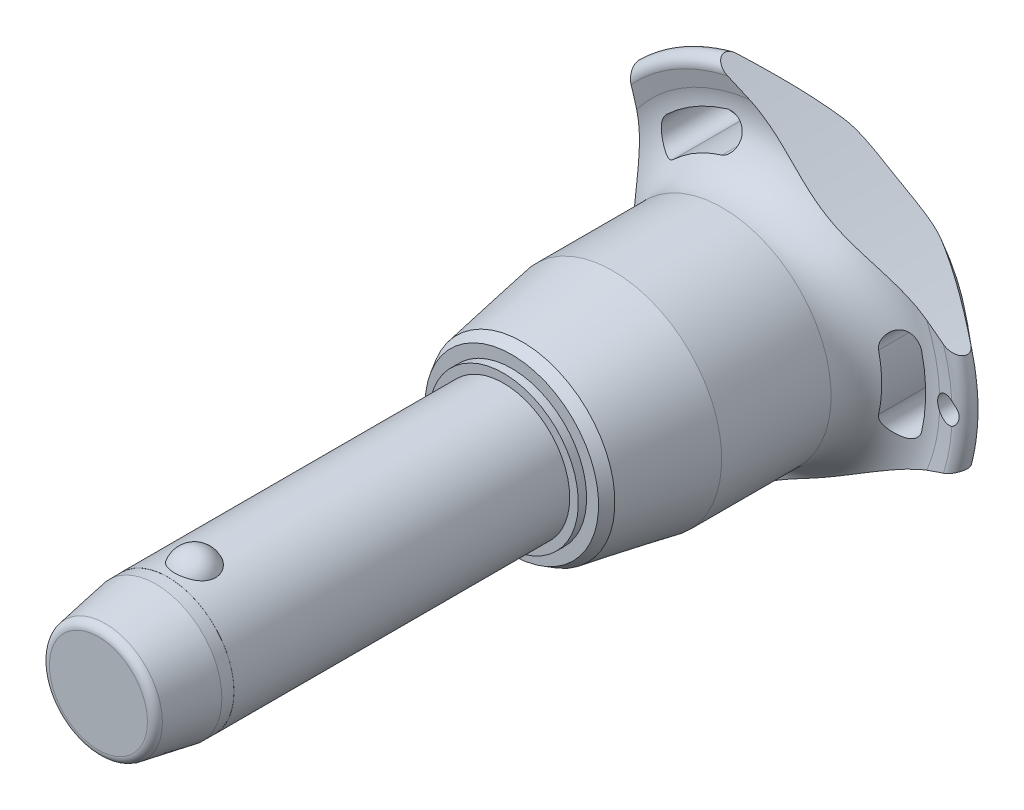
from build123d import *

# Parameters (mm, degrees)
SKETCH1_R           = 8
BOSS_EXTRUDE1_DEPTH = 35
SKETCH2_R           = 7
BOSS_EXTRUDE2_DEPTH = 39.7
BOSS_EXTRUDE3_START = 14
SKETCH1_2_R         = 8
BOSS_EXTRUDE3_DEPTH = 14
CHAMFER1_SIZE       = 7
CHAMFER1_SIZE2      = 1.234288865
FILLET1_R           = 1
SKETCH6_R           = 144.275
CUT_EXTRUDE1_DEPTH  = 82.935434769
CIRPATTERN1_COUNT   = 3
SKETCH7_R           = 1.5
CUT_EXTRUDE2_DEPTH  = 82.690131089
SKETCH8_R           = 8
SKETCH8_R_2         = 7.99
CUT_EXTRUDE3_DEPTH  = 8.4


with BuildPart() as part:
    # Sketch1 → Boss-Extrude1 (new body)
    with BuildSketch(Plane.XY):
        Circle(SKETCH1_R)
    extrude(amount=-BOSS_EXTRUDE1_DEPTH)

    # Sketch2 → Boss-Extrude2 (add)
    with BuildSketch(Plane(origin=(0, 0, -35), x_dir=(-1, 0, 0), z_dir=(0, 0, -1))):
        Circle(SKETCH2_R)
    extrude(amount=BOSS_EXTRUDE2_DEPTH)

    # Sketch3 → Revolve1 (revolve)
    with BuildSketch(Plane(origin=(0, 0, 0), x_dir=(0, 0, -1), z_dir=(1, 0, 0))):
        with BuildLine():
            Line((-2.387467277, 9.5), (-2.387467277, 4.2))
            ThreePointArc((-2.387467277, 4.2), (0.262532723, 6.85), (-2.387467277, 9.5))
        make_face()
        with BuildLine():
            Line((-2.387467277, -4.2), (-2.387467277, -9.5))
            ThreePointArc((-2.387467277, -9.5), (0.262532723, -6.85), (-2.387467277, -4.2))
        make_face()
    revolve(axis=Axis((0, -4.2, 2.387467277), (0, 1, 0)))

    # Sketch1_2 → Boss-Extrude3 (add)
    with BuildSketch(Plane.XY.offset(BOSS_EXTRUDE3_START)):
        Circle(SKETCH1_2_R)
    extrude(amount=-BOSS_EXTRUDE3_DEPTH)

    # Chamfer1
    chamfer1_edges = [part.edges().sort_by_distance(p)[0] for p in [
        (-8, 0, 14),
    ]]
    chamfer1_side = [part.faces().sort_by_distance(p)[0] for p in [
        (-8, 0, -10.5),
    ]]
    chamfer(chamfer1_edges, length=CHAMFER1_SIZE, length2=CHAMFER1_SIZE2, reference=chamfer1_side[0])

    # Fillet1
    fillet1_edges = [part.edges().sort_by_distance(p)[0] for p in [
        (-6.765711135, 0, 14),
        (7, 0, -74.7),
    ]]
    fillet(fillet1_edges, radius=FILLET1_R)

    # Sketch4 → Revolve2 (revolve)
    with BuildSketch(Plane(origin=(0, 0, 0), x_dir=(0, 0, -1), z_dir=(1, 0, 0)), mode=Mode.PRIVATE) as revolve2_sk:
        Polygon((35, 0), (35, 9.044607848), (36, 9.044607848), (36, 10.490707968), (37.25235944, 11.213758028), (48.233333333, 13.15), (61.466666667, 13.15), (61.466666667, 0), align=None)
    revolve(revolve2_sk.sketch.rotate(Axis((0, 0, -61.466666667), (0, 0, 1)), 90), axis=Axis((0, 0, -61.466666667), (0, 0, 1)))

    # Sketch5 → Revolve3 (revolve)
    with BuildSketch(Plane(origin=(0, 0, 0), x_dir=(0, 0, -1), z_dir=(1, 0, 0)), mode=Mode.PRIVATE) as revolve3_sk:
        with BuildLine():
            Line((67.32877039, 20.428960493), (66.910912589, 22.344207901))
            ThreePointArc((66.910912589, 22.344207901), (67.554394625, 23.677136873), (69.002586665, 23.371345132))
            Line((69.002586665, 23.371345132), (74.141488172, 17.247040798))
            ThreePointArc((74.141488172, 17.247040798), (74.7, 15.584758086), (73.978803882, 13.986322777))
            ThreePointArc((73.978803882, 13.986322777), (69.617427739, 7.589034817), (68.083333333, 0))
            Line((68.083333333, 0), (61.466666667, 0))
            Line((61.466666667, 0), (61.466666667, 13.15))
            ThreePointArc((61.466666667, 13.15), (66.139661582, 15.38660811), (67.32877039, 20.428960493))
        make_face()
    revolve(revolve3_sk.sketch.rotate(Axis((0, 0, -68.083333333), (0, 0, 1)), 90), axis=Axis((0, 0, -68.083333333), (0, 0, 1)))

    # Sketch6 → Cut-Extrude1 (cut, through all)
    with BuildSketch(Plane.XY):
        with Locations((-159.975, 0)):
            Circle(SKETCH6_R)
        with BuildLine():
            ThreePointArc((18.131206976, -4.190753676), (18.60922037, 0), (18.131206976, 4.190753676))
            ThreePointArc((18.131206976, 4.190753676), (15.94840906, 5.553949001), (14.585213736, 3.371151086))
            ThreePointArc((14.585213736, 3.371151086), (14.969740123, 0), (14.585213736, -3.371151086))
            ThreePointArc((14.585213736, -3.371151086), (15.94840906, -5.553949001), (18.131206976, -4.190753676))
        make_face()
    cut_extrude1 = extrude(amount=-CUT_EXTRUDE1_DEPTH, mode=Mode.SUBTRACT)

    # CirPattern1: Cut-Extrude1 ×3 about axis
    cirpattern1_axis = Axis((0, 0, 0), (0, 0, 1))
    for i in range(1, CIRPATTERN1_COUNT):
        add(cut_extrude1.rotate(cirpattern1_axis, i * 360 / CIRPATTERN1_COUNT), mode=Mode.SUBTRACT)

    # Sketch7 → Cut-Extrude2 (cut, through all)
    with BuildSketch(Plane.XY):
        with Locations(Location((21.60922037, 0, 0), (0, 0, 297.620773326))):
            Circle(SKETCH7_R)
    extrude(amount=-CUT_EXTRUDE2_DEPTH, mode=Mode.SUBTRACT)

    # Sketch8 → Cut-Extrude3 (cut)
    with BuildSketch(Plane.XY.offset(14)):
        Circle(SKETCH8_R)
        Circle(SKETCH8_R_2, mode=Mode.SUBTRACT)
    extrude(amount=-CUT_EXTRUDE3_DEPTH, mode=Mode.SUBTRACT)


solid = part.part
